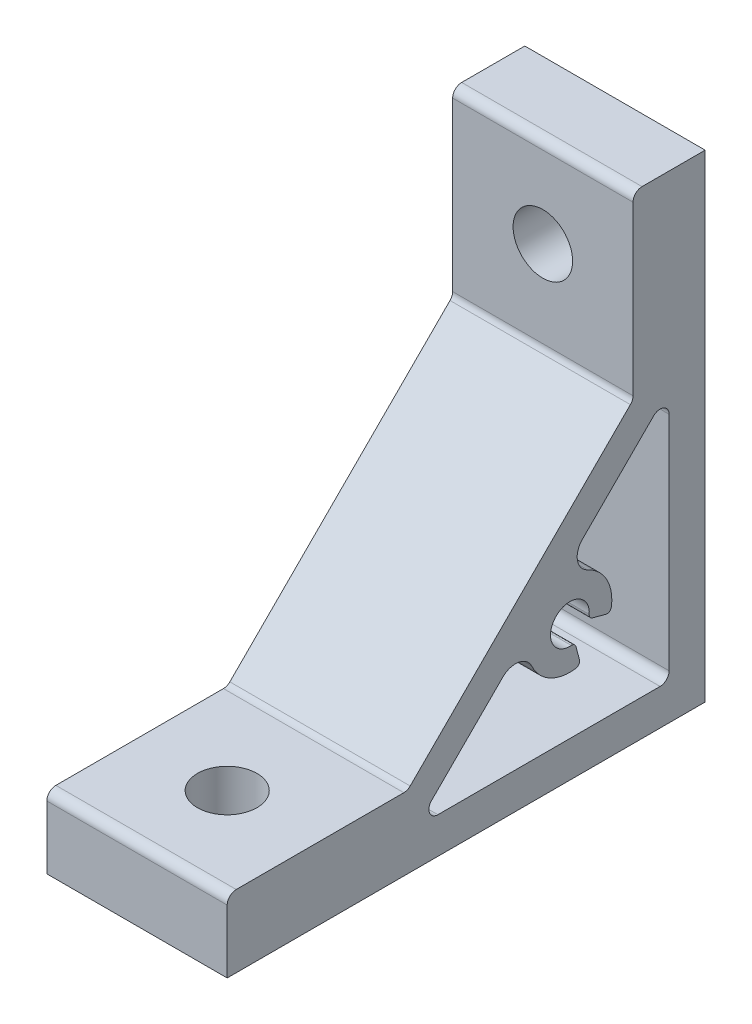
from build123d import *

# Parameters (mm, degrees)
EXTRUDE_1_DEPTH                   = 10
HOLE_WIZARD_6_6_6_6_1_D           = 6.6
HOLE_WIZARD_6_6_6_6_1_ON_FACE_2_D = 6.6


with BuildPart() as part:
    # Sketch 1 → Extrude 1 (new, symmetric)
    with BuildSketch(Plane(origin=(0, 0, 0), x_dir=(0, 0, -1), z_dir=(1, 0, 0))):
        with BuildLine():
            Line((0, 0), (0, 53))
            Line((0, 53), (-7, 53))
            ThreePointArc((-7, 53), (-7.707106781, 52.707106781), (-8, 52))
            Line((-8, 52), (-8, 33.414213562))
            ThreePointArc((-8, 33.414213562), (-8.076120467, 33.03153013), (-8.292893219, 32.707106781))
            Line((-8.292893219, 32.707106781), (-32.707106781, 8.292893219))
            ThreePointArc((-32.707106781, 8.292893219), (-33.03153013, 8.076120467), (-33.414213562, 8))
            Line((-33.414213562, 8), (-52, 8))
            ThreePointArc((-52, 8), (-52.707106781, 7.707106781), (-53, 7))
            Line((-53, 7), (-53, 0))
            Line((-53, 0), (0, 0))
        make_face()
        with BuildLine():
            Line((-4, 5), (-4, 29.636038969))
            ThreePointArc((-4, 29.636038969), (-4.617316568, 30.559918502), (-5.707106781, 30.343145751))
            Line((-5.707106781, 30.343145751), (-13.607410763, 22.442841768))
            ThreePointArc((-13.607410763, 22.442841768), (-14.162708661, 20.680742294), (-13.037348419, 19.215506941))
            ThreePointArc((-13.037348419, 19.215506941), (-10.912614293, 17.217155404), (-10.396162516, 14.346409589))
            ThreePointArc((-10.396162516, 14.346409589), (-10.615521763, 13.999552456), (-11.020608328, 13.933725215))
            Line((-11.020608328, 13.933725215), (-12.486271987, 14.326448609))
            ThreePointArc((-12.486271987, 14.326448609), (-12.764234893, 14.519501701), (-12.85556766, 14.845371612))
            ThreePointArc((-12.85556766, 14.845371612), (-16.52027958, 16.52027958), (-14.845371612, 12.85556766))
            ThreePointArc((-14.845371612, 12.85556766), (-14.519501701, 12.764234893), (-14.326448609, 12.486271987))
            Line((-14.326448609, 12.486271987), (-13.933725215, 11.020608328))
            ThreePointArc((-13.933725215, 11.020608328), (-13.999552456, 10.615521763), (-14.346409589, 10.396162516))
            ThreePointArc((-14.346409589, 10.396162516), (-17.217155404, 10.912614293), (-19.215506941, 13.037348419))
            ThreePointArc((-19.215506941, 13.037348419), (-20.680742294, 14.162708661), (-22.442841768, 13.607410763))
            Line((-22.442841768, 13.607410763), (-30.343145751, 5.707106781))
            ThreePointArc((-30.343145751, 5.707106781), (-30.559918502, 4.617316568), (-29.636038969, 4))
            Line((-29.636038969, 4), (-5, 4))
            ThreePointArc((-5, 4), (-4.292893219, 4.292893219), (-4, 5))
        make_face(mode=Mode.SUBTRACT)
    extrude(amount=EXTRUDE_1_DEPTH, both=True)

    # Hole Wizard 6.6 _6.6_ _1 (through all)
    with Locations(Plane(origin=(0, 43, 8), x_dir=(1, 0, 0), z_dir=(0, 0, 1))):
        with Locations((0, 0)):
            Hole(HOLE_WIZARD_6_6_6_6_1_D / 2)

    # Hole Wizard 6.6 _6.6_ _1 on face 2 (through all)
    with Locations(Plane(origin=(0, 8, 43), x_dir=(0, 0, 1), z_dir=(0, 1, 0))):
        with Locations((0, 0)):
            Hole(HOLE_WIZARD_6_6_6_6_1_ON_FACE_2_D / 2)


solid = part.part
